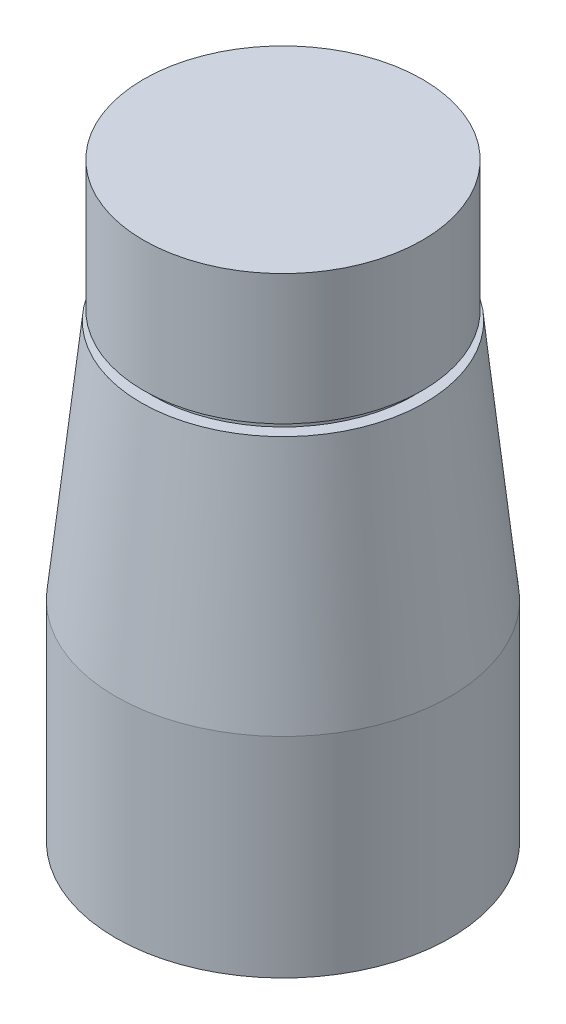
from build123d import *


with BuildPart() as part:
    # Sketch1 → Revolve1 (revolve)
    with BuildSketch(Plane.XY, mode=Mode.PRIVATE) as revolve1_sk:
        Polygon((0, 0), (-18, 0), (-18, 22.5), (-15.267289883, 48.5), (-14, 48.5), (-14, 49.5), (-15, 49.5), (-15, 63.5), (0, 63.5), align=None)
    revolve(revolve1_sk.sketch.rotate(Axis((0, 85.10264496, 0), (0, -1, 0)), 270), axis=Axis((0, 85.10264496, 0), (0, -1, 0)))


solid = part.part
